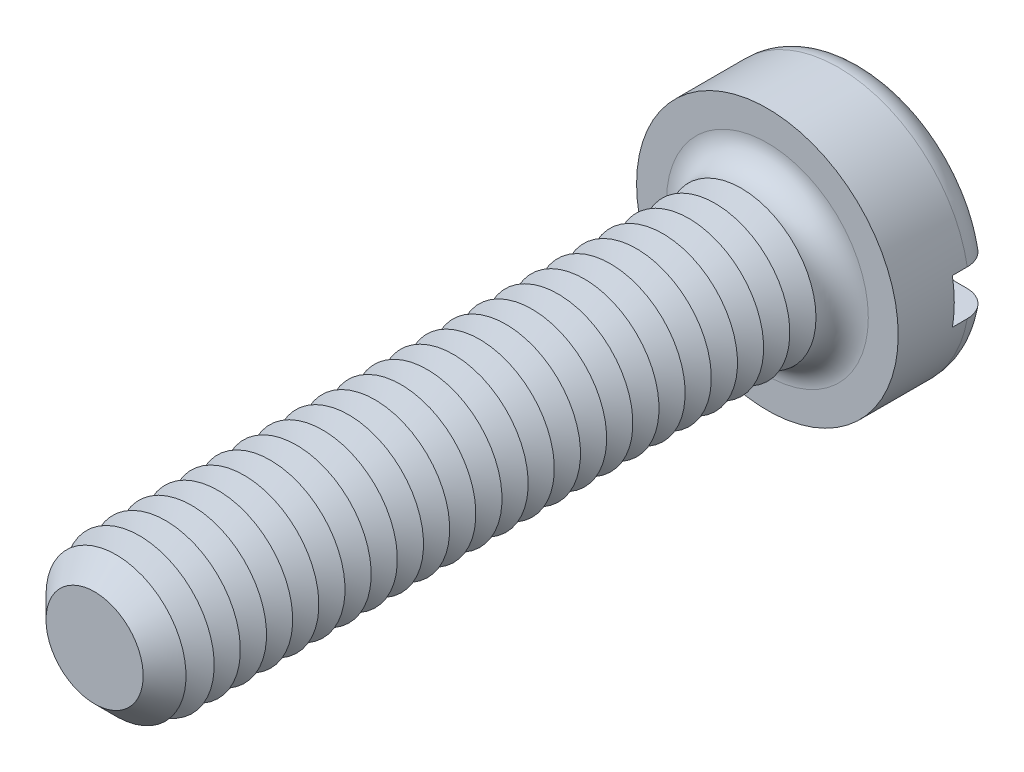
from build123d import *

# Parameters (mm, degrees)
SKETCH3_R           = 3.5
BOSS_EXTRUDE2_DEPTH = 2.6
SKETCH4_R           = 2
BOSS_EXTRUDE3_DEPTH = 18
FILLET1_R           = 0.7
CHAMFER1_SIZE       = 0.7
LPATTERN1_COUNT     = 24
LPATTERN1_PITCH     = 0.7
SKETCH8_W           = 7
SKETCH8_H           = 1.2
CUT_EXTRUDE1_DEPTH  = 1.1


with BuildPart() as part:
    # Sketch3 → Boss-Extrude2 (new body)
    with BuildSketch(Plane.XY):
        Circle(SKETCH3_R)
    extrude(amount=-BOSS_EXTRUDE2_DEPTH)

    # Sketch4 → Boss-Extrude3 (add)
    with BuildSketch(Plane.XY):
        Circle(SKETCH4_R)
    extrude(amount=BOSS_EXTRUDE3_DEPTH)

    # Fillet1
    fillet1_edges = [part.edges().sort_by_distance(p)[0] for p in [
        (-3.5, 0, -2.6),
        (-2, 0, 0),
    ]]
    fillet(fillet1_edges, radius=FILLET1_R)

    # Chamfer1
    chamfer1_edges = [part.edges().sort_by_distance(p)[0] for p in [
        (-2, 0, 18),
    ]]
    chamfer(chamfer1_edges, length=CHAMFER1_SIZE)

    # Sketch6 → Cut-Revolve1 (revolve, cut)
    with BuildSketch(Plane(origin=(0, 0, 0), x_dir=(0, 0, -1), z_dir=(1, 0, 0)), mode=Mode.PRIVATE) as cut_revolve1_sk:
        Polygon((-0.7, 2), (-1.05, 1.393782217), (-1.4, 2), align=None)
    cut_revolve1 = revolve(cut_revolve1_sk.sketch.rotate(Axis((0, 0, -1.694361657), (0, 0, 1)), 90), axis=Axis((0, 0, -1.694361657), (0, 0, 1)), mode=Mode.SUBTRACT)

    # LPattern1: Cut-Revolve1 ×24
    with Locations(*[(0, 0, i * LPATTERN1_PITCH) for i in range(1, LPATTERN1_COUNT)]):
        add(cut_revolve1, mode=Mode.SUBTRACT)

    # Sketch8 → Cut-Extrude1 (cut)
    with BuildSketch(Plane(origin=(0, 0, -2.6), x_dir=(-1, 0, 0), z_dir=(0, 0, -1))):
        Rectangle(SKETCH8_W, SKETCH8_H)
    extrude(amount=-CUT_EXTRUDE1_DEPTH, mode=Mode.SUBTRACT)


solid = part.part
